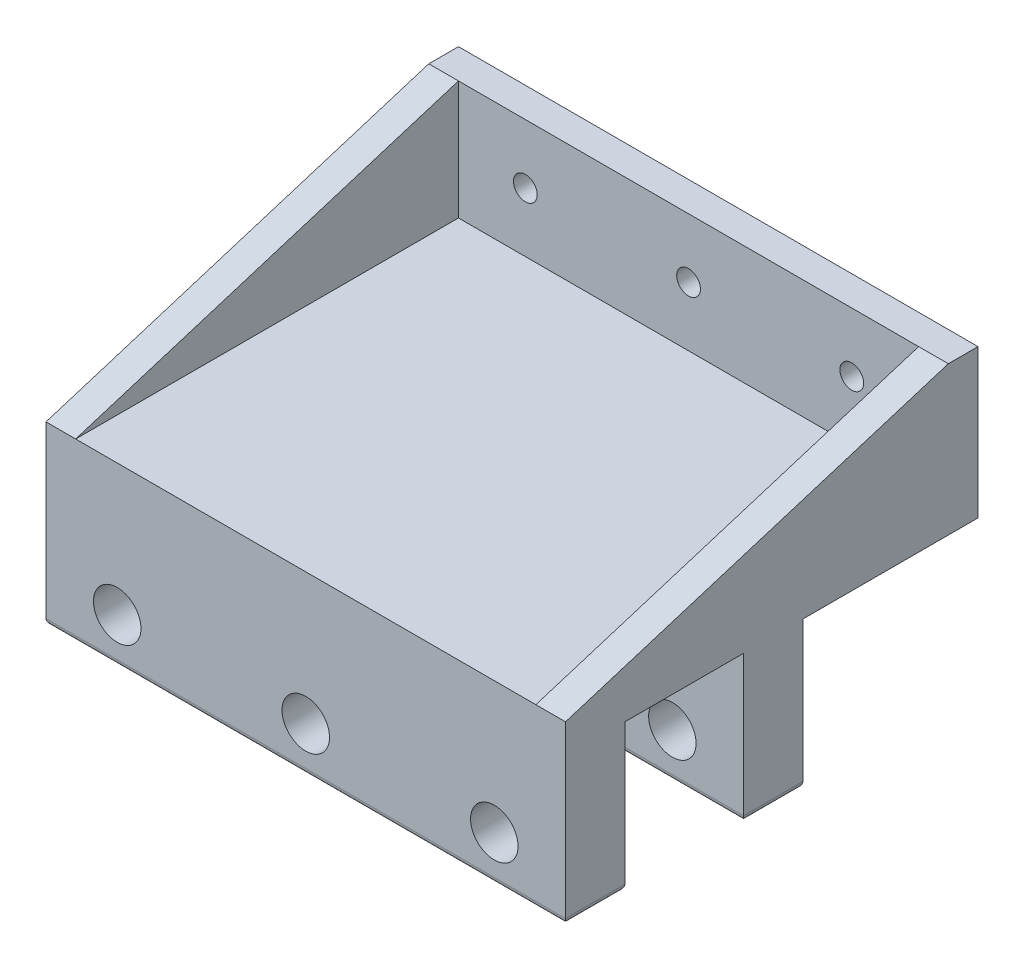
ISO-10303-21;
HEADER;
FILE_DESCRIPTION(('STEP AP214'),'2;1');
FILE_NAME('part.step','',(''),(''),'','','');
FILE_SCHEMA(('AUTOMOTIVE_DESIGN { 1 0 10303 214 1 1 1 1 }'));
ENDSEC;
DATA;
#1=APPLICATION_CONTEXT('core data for automotive mechanical design processes');
#2=APPLICATION_PROTOCOL_DEFINITION('international standard','automotive_design',2000,#1);
#3=PRODUCT_CONTEXT('',#1,'mechanical');
#4=PRODUCT('Part','Part','',(#3));
#5=PRODUCT_RELATED_PRODUCT_CATEGORY('part','',(#4));
#6=PRODUCT_DEFINITION_FORMATION('','',#4);
#7=PRODUCT_DEFINITION_CONTEXT('part definition',#1,'design');
#8=PRODUCT_DEFINITION('design','',#6,#7);
#9=PRODUCT_DEFINITION_SHAPE('','',#8);
#10=(LENGTH_UNIT() NAMED_UNIT(*) SI_UNIT(.MILLI.,.METRE.));
#11=(NAMED_UNIT(*) PLANE_ANGLE_UNIT() SI_UNIT($,.RADIAN.));
#12=(NAMED_UNIT(*) SI_UNIT($,.STERADIAN.) SOLID_ANGLE_UNIT());
#13=UNCERTAINTY_MEASURE_WITH_UNIT(LENGTH_MEASURE(1.E-05),#10,'distance_accuracy_value','');
#14=(GEOMETRIC_REPRESENTATION_CONTEXT(3) GLOBAL_UNCERTAINTY_ASSIGNED_CONTEXT((#13)) GLOBAL_UNIT_ASSIGNED_CONTEXT((#10,
#11,#12)) REPRESENTATION_CONTEXT('',''));
#15=CARTESIAN_POINT('',(0.,0.,0.));
#16=DIRECTION('',(0.,0.,1.));
#17=DIRECTION('',(1.,0.,0.));
#18=AXIS2_PLACEMENT_3D('',#15,#16,#17);
#19=CARTESIAN_POINT('',(91.4321626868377,17.1642721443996,-64.5));
#20=DIRECTION('',(0.,1.,0.));
#21=DIRECTION('',(0.,0.,1.));
#22=AXIS2_PLACEMENT_3D('',#19,#20,#21);
#23=PLANE('',#22);
#24=DIRECTION('',(1.,0.,0.));
#25=VECTOR('',#24,1.);
#26=CARTESIAN_POINT('',(3.89366137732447,17.1642721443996,-5.));
#27=LINE('',#26,#25);
#28=CARTESIAN_POINT('',(3.89366137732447,17.1642721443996,-5.));
#29=VERTEX_POINT('',#28);
#30=CARTESIAN_POINT('',(91.4321626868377,17.1642721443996,-5.));
#31=VERTEX_POINT('',#30);
#32=EDGE_CURVE('E179',#29,#31,#27,.T.);
#33=ORIENTED_EDGE('',*,*,#32,.F.);
#34=DIRECTION('',(0.,0.,1.));
#35=VECTOR('',#34,1.);
#36=CARTESIAN_POINT('',(3.89366137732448,17.1642721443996,-64.5));
#37=LINE('',#36,#35);
#38=CARTESIAN_POINT('',(3.89366137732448,17.1642721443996,-25.));
#39=VERTEX_POINT('',#38);
#40=EDGE_CURVE('E193',#39,#29,#37,.T.);
#41=ORIENTED_EDGE('',*,*,#40,.F.);
#42=DIRECTION('',(1.,0.,0.));
#43=VECTOR('',#42,1.);
#44=CARTESIAN_POINT('',(3.89366137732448,17.1642721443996,-25.));
#45=LINE('',#44,#43);
#46=CARTESIAN_POINT('',(91.4321626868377,17.1642721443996,-25.));
#47=VERTEX_POINT('',#46);
#48=EDGE_CURVE('E418',#39,#47,#45,.T.);
#49=ORIENTED_EDGE('',*,*,#48,.T.);
#50=DIRECTION('',(0.,0.,1.));
#51=VECTOR('',#50,1.);
#52=CARTESIAN_POINT('',(91.4321626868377,17.1642721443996,-64.5));
#53=LINE('',#52,#51);
#54=EDGE_CURVE('E196',#47,#31,#53,.T.);
#55=ORIENTED_EDGE('',*,*,#54,.T.);
#56=EDGE_LOOP('',(#33,#41,#49,#55));
#57=FACE_BOUND('',#56,.T.);
#58=ADVANCED_FACE('F46',(#57),#23,.F.);
#59=CARTESIAN_POINT('',(3.89366137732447,0.,5.));
#60=DIRECTION('',(1.,0.,0.));
#61=DIRECTION('',(0.,1.,0.));
#62=AXIS2_PLACEMENT_3D('',#59,#60,#61);
#63=PLANE('',#62);
#64=DIRECTION('',(0.,1.,0.));
#65=VECTOR('',#64,1.);
#66=CARTESIAN_POINT('',(3.89366137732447,-95.6477064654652,-35.));
#67=LINE('',#66,#65);
#68=CARTESIAN_POINT('',(3.89366137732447,-6.5398792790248,-35.));
#69=VERTEX_POINT('',#68);
#70=CARTESIAN_POINT('',(3.89366137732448,17.1642721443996,-35.));
#71=VERTEX_POINT('',#70);
#72=EDGE_CURVE('E421',#69,#71,#67,.T.);
#73=ORIENTED_EDGE('',*,*,#72,.F.);
#74=DIRECTION('',(0.,0.,1.));
#75=VECTOR('',#74,1.);
#76=CARTESIAN_POINT('',(3.89366137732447,-6.53987927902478,5.));
#77=LINE('',#76,#75);
#78=CARTESIAN_POINT('',(3.89366137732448,-6.5398792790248,-25.));
#79=VERTEX_POINT('',#78);
#80=EDGE_CURVE('E263',#69,#79,#77,.T.);
#81=ORIENTED_EDGE('',*,*,#80,.T.);
#82=DIRECTION('',(0.,1.,0.));
#83=VECTOR('',#82,1.);
#84=CARTESIAN_POINT('',(3.89366137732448,-95.6477064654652,-25.));
#85=LINE('',#84,#83);
#86=EDGE_CURVE('E204',#79,#39,#85,.T.);
#87=ORIENTED_EDGE('',*,*,#86,.T.);
#88=ORIENTED_EDGE('',*,*,#40,.T.);
#89=DIRECTION('',(0.,1.,0.));
#90=VECTOR('',#89,1.);
#91=CARTESIAN_POINT('',(3.89366137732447,-95.2210586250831,-5.));
#92=LINE('',#91,#90);
#93=CARTESIAN_POINT('',(3.89366137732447,-6.5398792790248,-5.));
#94=VERTEX_POINT('',#93);
#95=EDGE_CURVE('E175',#94,#29,#92,.T.);
#96=ORIENTED_EDGE('',*,*,#95,.F.);
#97=DIRECTION('',(0.,0.,-1.));
#98=VECTOR('',#97,1.);
#99=CARTESIAN_POINT('',(3.89366137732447,-6.53987927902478,5.));
#100=LINE('',#99,#98);
#101=CARTESIAN_POINT('',(3.89366137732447,-6.53987927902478,5.));
#102=VERTEX_POINT('',#101);
#103=EDGE_CURVE('E260',#94,#102,#100,.F.);
#104=ORIENTED_EDGE('',*,*,#103,.T.);
#105=DIRECTION('',(0.,-1.,0.));
#106=VECTOR('',#105,1.);
#107=CARTESIAN_POINT('',(3.89366137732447,0.,5.));
#108=LINE('',#107,#106);
#109=CARTESIAN_POINT('',(3.89366137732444,22.1642721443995,5.));
#110=VERTEX_POINT('',#109);
#111=EDGE_CURVE('E229',#110,#102,#108,.T.);
#112=ORIENTED_EDGE('',*,*,#111,.F.);
#113=DIRECTION('',(0.,-0.296166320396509,0.95513638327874));
#114=VECTOR('',#113,1.);
#115=CARTESIAN_POINT('',(3.89366137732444,21.6345404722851,6.70838464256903));
#116=LINE('',#115,#114);
#117=CARTESIAN_POINT('',(3.89366137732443,42.1642721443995,-59.5));
#118=VERTEX_POINT('',#117);
#119=EDGE_CURVE('E371',#118,#110,#116,.T.);
#120=ORIENTED_EDGE('',*,*,#119,.F.);
#121=DIRECTION('',(0.,0.,-1.));
#122=VECTOR('',#121,1.);
#123=CARTESIAN_POINT('',(3.89366137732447,42.1642721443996,-59.5));
#124=LINE('',#123,#122);
#125=CARTESIAN_POINT('',(3.89366137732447,42.1642721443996,-64.5));
#126=VERTEX_POINT('',#125);
#127=EDGE_CURVE('E440',#118,#126,#124,.T.);
#128=ORIENTED_EDGE('',*,*,#127,.T.);
#129=DIRECTION('',(0.,1.,0.));
#130=VECTOR('',#129,1.);
#131=CARTESIAN_POINT('',(3.89366137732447,22.1642721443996,-64.5));
#132=LINE('',#131,#130);
#133=CARTESIAN_POINT('',(3.89366137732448,17.1642721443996,-64.5));
#134=VERTEX_POINT('',#133);
#135=EDGE_CURVE('E207',#134,#126,#132,.T.);
#136=ORIENTED_EDGE('',*,*,#135,.F.);
#137=EDGE_CURVE('E206',#134,#71,#37,.T.);
#138=ORIENTED_EDGE('',*,*,#137,.T.);
#139=EDGE_LOOP('',(#73,#81,#87,#88,#96,#104,#112,#120,#128,#136,#138));
#140=FACE_BOUND('',#139,.T.);
#141=ADVANCED_FACE('F201',(#140),#63,.F.);
#142=CARTESIAN_POINT('',(91.4321626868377,0.,5.));
#143=DIRECTION('',(1.,0.,0.));
#144=DIRECTION('',(0.,1.,0.));
#145=AXIS2_PLACEMENT_3D('',#142,#143,#144);
#146=PLANE('',#145);
#147=DIRECTION('',(0.,1.,0.));
#148=VECTOR('',#147,1.);
#149=CARTESIAN_POINT('',(91.4321626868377,-95.6477064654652,-25.));
#150=LINE('',#149,#148);
#151=CARTESIAN_POINT('',(91.4321626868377,-6.53987927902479,-25.));
#152=VERTEX_POINT('',#151);
#153=EDGE_CURVE('E426',#152,#47,#150,.T.);
#154=ORIENTED_EDGE('',*,*,#153,.F.);
#155=DIRECTION('',(0.,0.,-1.));
#156=VECTOR('',#155,1.);
#157=CARTESIAN_POINT('',(91.4321626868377,-6.53987927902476,-35.));
#158=LINE('',#157,#156);
#159=CARTESIAN_POINT('',(91.4321626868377,-6.53987927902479,-35.));
#160=VERTEX_POINT('',#159);
#161=EDGE_CURVE('E70',#152,#160,#158,.T.);
#162=ORIENTED_EDGE('',*,*,#161,.T.);
#163=DIRECTION('',(0.,1.,0.));
#164=VECTOR('',#163,1.);
#165=CARTESIAN_POINT('',(91.4321626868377,-95.6477064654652,-35.));
#166=LINE('',#165,#164);
#167=CARTESIAN_POINT('',(91.4321626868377,17.1642721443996,-35.));
#168=VERTEX_POINT('',#167);
#169=EDGE_CURVE('E429',#160,#168,#166,.T.);
#170=ORIENTED_EDGE('',*,*,#169,.T.);
#171=CARTESIAN_POINT('',(91.4321626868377,17.1642721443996,-64.5));
#172=VERTEX_POINT('',#171);
#173=EDGE_CURVE('E217',#172,#168,#53,.T.);
#174=ORIENTED_EDGE('',*,*,#173,.F.);
#175=DIRECTION('',(0.,-1.,0.));
#176=VECTOR('',#175,1.);
#177=CARTESIAN_POINT('',(91.4321626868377,22.1642721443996,-64.5));
#178=LINE('',#177,#176);
#179=CARTESIAN_POINT('',(91.4321626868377,42.1642721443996,-64.5));
#180=VERTEX_POINT('',#179);
#181=EDGE_CURVE('E447',#180,#172,#178,.T.);
#182=ORIENTED_EDGE('',*,*,#181,.F.);
#183=DIRECTION('',(0.,0.,-1.));
#184=VECTOR('',#183,1.);
#185=CARTESIAN_POINT('',(91.4321626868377,42.1642721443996,-59.5));
#186=LINE('',#185,#184);
#187=CARTESIAN_POINT('',(91.4321626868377,42.1642721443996,-59.5));
#188=VERTEX_POINT('',#187);
#189=EDGE_CURVE('E444',#188,#180,#186,.T.);
#190=ORIENTED_EDGE('',*,*,#189,.F.);
#191=DIRECTION('',(0.,-0.296166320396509,0.95513638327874));
#192=VECTOR('',#191,1.);
#193=CARTESIAN_POINT('',(91.4321626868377,21.6345404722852,6.70838464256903));
#194=LINE('',#193,#192);
#195=CARTESIAN_POINT('',(91.4321626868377,22.1642721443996,5.));
#196=VERTEX_POINT('',#195);
#197=EDGE_CURVE('E351',#188,#196,#194,.T.);
#198=ORIENTED_EDGE('',*,*,#197,.T.);
#199=DIRECTION('',(0.,-1.,0.));
#200=VECTOR('',#199,1.);
#201=CARTESIAN_POINT('',(91.4321626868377,0.,5.));
#202=LINE('',#201,#200);
#203=CARTESIAN_POINT('',(91.4321626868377,-6.53987927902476,5.));
#204=VERTEX_POINT('',#203);
#205=EDGE_CURVE('E232',#196,#204,#202,.T.);
#206=ORIENTED_EDGE('',*,*,#205,.T.);
#207=DIRECTION('',(0.,0.,-1.));
#208=VECTOR('',#207,1.);
#209=CARTESIAN_POINT('',(91.4321626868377,-6.53987927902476,-5.));
#210=LINE('',#209,#208);
#211=CARTESIAN_POINT('',(91.4321626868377,-6.53987927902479,-5.));
#212=VERTEX_POINT('',#211);
#213=EDGE_CURVE('E292',#204,#212,#210,.T.);
#214=ORIENTED_EDGE('',*,*,#213,.T.);
#215=DIRECTION('',(0.,1.,0.));
#216=VECTOR('',#215,1.);
#217=CARTESIAN_POINT('',(91.4321626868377,-95.2210586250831,-5.));
#218=LINE('',#217,#216);
#219=EDGE_CURVE('E188',#212,#31,#218,.T.);
#220=ORIENTED_EDGE('',*,*,#219,.T.);
#221=ORIENTED_EDGE('',*,*,#54,.F.);
#222=EDGE_LOOP('',(#154,#162,#170,#174,#182,#190,#198,#206,#214,#220,#221));
#223=FACE_BOUND('',#222,.T.);
#224=ADVANCED_FACE('F341',(#223),#146,.T.);
#225=CARTESIAN_POINT('',(0.,0.,5.));
#226=DIRECTION('',(0.,0.,1.));
#227=DIRECTION('',(1.,0.,0.));
#228=AXIS2_PLACEMENT_3D('',#225,#226,#227);
#229=PLANE('',#228);
#230=CARTESIAN_POINT('',(47.662912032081,0.,5.));
#231=DIRECTION('',(0.,0.,1.));
#232=DIRECTION('',(1.,0.,0.));
#233=AXIS2_PLACEMENT_3D('',#230,#231,#232);
#234=CIRCLE('',#233,4.);
#235=CARTESIAN_POINT('',(51.662912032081,0.,5.));
#236=VERTEX_POINT('',#235);
#237=EDGE_CURVE('E221',#236,#236,#234,.T.);
#238=ORIENTED_EDGE('',*,*,#237,.F.);
#239=EDGE_LOOP('',(#238));
#240=FACE_BOUND('',#239,.T.);
#241=CARTESIAN_POINT('',(79.4321626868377,0.,5.));
#242=DIRECTION('',(0.,0.,1.));
#243=DIRECTION('',(1.,0.,0.));
#244=AXIS2_PLACEMENT_3D('',#241,#242,#243);
#245=CIRCLE('',#244,4.00000000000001);
#246=CARTESIAN_POINT('',(83.4321626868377,0.,5.));
#247=VERTEX_POINT('',#246);
#248=EDGE_CURVE('E225',#247,#247,#245,.T.);
#249=ORIENTED_EDGE('',*,*,#248,.F.);
#250=EDGE_LOOP('',(#249));
#251=FACE_BOUND('',#250,.T.);
#252=CARTESIAN_POINT('',(15.8936613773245,0.,5.));
#253=DIRECTION('',(0.,0.,1.));
#254=DIRECTION('',(1.,0.,0.));
#255=AXIS2_PLACEMENT_3D('',#252,#253,#254);
#256=CIRCLE('',#255,4.);
#257=CARTESIAN_POINT('',(19.8936613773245,0.,5.));
#258=VERTEX_POINT('',#257);
#259=EDGE_CURVE('E239',#258,#258,#256,.T.);
#260=ORIENTED_EDGE('',*,*,#259,.F.);
#261=EDGE_LOOP('',(#260));
#262=FACE_BOUND('',#261,.T.);
#263=ORIENTED_EDGE('',*,*,#111,.T.);
#264=DIRECTION('',(1.,0.,0.));
#265=VECTOR('',#264,1.);
#266=CARTESIAN_POINT('',(91.4321626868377,-6.53987927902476,5.));
#267=LINE('',#266,#265);
#268=EDGE_CURVE('E11',#102,#204,#267,.T.);
#269=ORIENTED_EDGE('',*,*,#268,.T.);
#270=ORIENTED_EDGE('',*,*,#205,.F.);
#271=DIRECTION('',(1.,0.,0.));
#272=VECTOR('',#271,1.);
#273=CARTESIAN_POINT('',(3.89366137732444,22.1642721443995,5.));
#274=LINE('',#273,#272);
#275=CARTESIAN_POINT('',(86.4321626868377,22.1642721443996,5.));
#276=VERTEX_POINT('',#275);
#277=EDGE_CURVE('E381',#276,#196,#274,.T.);
#278=ORIENTED_EDGE('',*,*,#277,.F.);
#279=DIRECTION('',(1.,0.,0.));
#280=VECTOR('',#279,1.);
#281=CARTESIAN_POINT('',(0.,22.1642721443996,5.));
#282=LINE('',#281,#280);
#283=CARTESIAN_POINT('',(8.89366137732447,22.1642721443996,5.00000000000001));
#284=VERTEX_POINT('',#283);
#285=EDGE_CURVE('E235',#284,#276,#282,.T.);
#286=ORIENTED_EDGE('',*,*,#285,.F.);
#287=EDGE_CURVE('E377',#110,#284,#274,.T.);
#288=ORIENTED_EDGE('',*,*,#287,.F.);
#289=EDGE_LOOP('',(#263,#269,#270,#278,#286,#288));
#290=FACE_BOUND('',#289,.T.);
#291=ADVANCED_FACE('F544',(#240,#251,#262,#290),#229,.T.);
#292=CARTESIAN_POINT('',(91.4321626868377,42.1642721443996,-59.5));
#293=DIRECTION('',(0.,1.,0.));
#294=DIRECTION('',(0.,0.,1.));
#295=AXIS2_PLACEMENT_3D('',#292,#293,#294);
#296=PLANE('',#295);
#297=ORIENTED_EDGE('',*,*,#127,.F.);
#298=DIRECTION('',(1.,0.,0.));
#299=VECTOR('',#298,1.);
#300=CARTESIAN_POINT('',(3.89366137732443,42.1642721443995,-59.5));
#301=LINE('',#300,#299);
#302=CARTESIAN_POINT('',(8.89366137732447,42.1642721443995,-59.5));
#303=VERTEX_POINT('',#302);
#304=EDGE_CURVE('E382',#118,#303,#301,.T.);
#305=ORIENTED_EDGE('',*,*,#304,.T.);
#306=DIRECTION('',(1.,0.,0.));
#307=VECTOR('',#306,1.);
#308=CARTESIAN_POINT('',(91.4321626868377,42.1642721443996,-59.5));
#309=LINE('',#308,#307);
#310=CARTESIAN_POINT('',(86.4321626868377,42.1642721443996,-59.5));
#311=VERTEX_POINT('',#310);
#312=EDGE_CURVE('E436',#303,#311,#309,.T.);
#313=ORIENTED_EDGE('',*,*,#312,.T.);
#314=EDGE_CURVE('E374',#311,#188,#301,.T.);
#315=ORIENTED_EDGE('',*,*,#314,.T.);
#316=ORIENTED_EDGE('',*,*,#189,.T.);
#317=DIRECTION('',(1.,0.,0.));
#318=VECTOR('',#317,1.);
#319=CARTESIAN_POINT('',(91.4321626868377,42.1642721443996,-64.5));
#320=LINE('',#319,#318);
#321=EDGE_CURVE('E432',#126,#180,#320,.T.);
#322=ORIENTED_EDGE('',*,*,#321,.F.);
#323=EDGE_LOOP('',(#297,#305,#313,#315,#316,#322));
#324=FACE_BOUND('',#323,.T.);
#325=ADVANCED_FACE('F467',(#324),#296,.T.);
#326=CARTESIAN_POINT('',(8.89366137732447,42.1642721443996,25.6155281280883));
#327=DIRECTION('',(1.,0.,0.));
#328=DIRECTION('',(0.,1.,0.));
#329=AXIS2_PLACEMENT_3D('',#326,#327,#328);
#330=PLANE('',#329);
#331=DIRECTION('',(0.,-1.,0.));
#332=VECTOR('',#331,1.);
#333=CARTESIAN_POINT('',(8.89366137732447,42.1642721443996,-59.5));
#334=LINE('',#333,#332);
#335=CARTESIAN_POINT('',(8.89366137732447,22.1642721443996,-59.5));
#336=VERTEX_POINT('',#335);
#337=EDGE_CURVE('E397',#303,#336,#334,.T.);
#338=ORIENTED_EDGE('',*,*,#337,.F.);
#339=DIRECTION('',(0.,-0.296166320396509,0.95513638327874));
#340=VECTOR('',#339,1.);
#341=CARTESIAN_POINT('',(8.89366137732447,18.0868572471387,18.1496630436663));
#342=LINE('',#341,#340);
#343=EDGE_CURVE('E380',#303,#284,#342,.T.);
#344=ORIENTED_EDGE('',*,*,#343,.T.);
#345=DIRECTION('',(0.,0.,-1.));
#346=VECTOR('',#345,1.);
#347=CARTESIAN_POINT('',(8.89366137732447,22.1642721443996,25.6155281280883));
#348=LINE('',#347,#346);
#349=EDGE_CURVE('E394',#284,#336,#348,.T.);
#350=ORIENTED_EDGE('',*,*,#349,.T.);
#351=EDGE_LOOP('',(#338,#344,#350));
#352=FACE_BOUND('',#351,.T.);
#353=ADVANCED_FACE('F543',(#352),#330,.T.);
#354=CARTESIAN_POINT('',(86.4321626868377,42.1642721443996,25.6155281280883));
#355=DIRECTION('',(1.,0.,0.));
#356=DIRECTION('',(0.,0.,-1.));
#357=AXIS2_PLACEMENT_3D('',#354,#355,#356);
#358=PLANE('',#357);
#359=DIRECTION('',(0.,-0.296166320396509,0.95513638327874));
#360=VECTOR('',#359,1.);
#361=CARTESIAN_POINT('',(86.4321626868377,18.0868572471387,18.1496630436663));
#362=LINE('',#361,#360);
#363=EDGE_CURVE('E243',#311,#276,#362,.T.);
#364=ORIENTED_EDGE('',*,*,#363,.F.);
#365=DIRECTION('',(0.,-1.,0.));
#366=VECTOR('',#365,1.);
#367=CARTESIAN_POINT('',(86.4321626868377,42.1642721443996,-59.5));
#368=LINE('',#367,#366);
#369=CARTESIAN_POINT('',(86.4321626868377,22.1642721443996,-59.5));
#370=VERTEX_POINT('',#369);
#371=EDGE_CURVE('E389',#311,#370,#368,.T.);
#372=ORIENTED_EDGE('',*,*,#371,.T.);
#373=DIRECTION('',(0.,0.,-1.));
#374=VECTOR('',#373,1.);
#375=CARTESIAN_POINT('',(86.4321626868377,22.1642721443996,25.6155281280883));
#376=LINE('',#375,#374);
#377=EDGE_CURVE('E390',#276,#370,#376,.T.);
#378=ORIENTED_EDGE('',*,*,#377,.F.);
#379=EDGE_LOOP('',(#364,#372,#378));
#380=FACE_BOUND('',#379,.T.);
#381=ADVANCED_FACE('F536',(#380),#358,.F.);
#382=CARTESIAN_POINT('',(0.,22.1642721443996,5.));
#383=DIRECTION('',(0.,1.,0.));
#384=DIRECTION('',(0.,0.,1.));
#385=AXIS2_PLACEMENT_3D('',#382,#383,#384);
#386=PLANE('',#385);
#387=ORIENTED_EDGE('',*,*,#285,.T.);
#388=ORIENTED_EDGE('',*,*,#377,.T.);
#389=DIRECTION('',(-1.,0.,0.));
#390=VECTOR('',#389,1.);
#391=CARTESIAN_POINT('',(91.4321626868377,22.1642721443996,-59.5));
#392=LINE('',#391,#390);
#393=EDGE_CURVE('E433',#370,#336,#392,.T.);
#394=ORIENTED_EDGE('',*,*,#393,.T.);
#395=ORIENTED_EDGE('',*,*,#349,.F.);
#396=EDGE_LOOP('',(#387,#388,#394,#395));
#397=FACE_BOUND('',#396,.T.);
#398=ADVANCED_FACE('F530',(#397),#386,.T.);
#399=CARTESIAN_POINT('',(0.,0.,-59.5));
#400=DIRECTION('',(0.,0.,1.));
#401=DIRECTION('',(1.,0.,0.));
#402=AXIS2_PLACEMENT_3D('',#399,#400,#401);
#403=PLANE('',#402);
#404=CARTESIAN_POINT('',(20.1629120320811,32.1642721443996,-59.5));
#405=DIRECTION('',(0.,0.,1.));
#406=DIRECTION('',(1.,0.,0.));
#407=AXIS2_PLACEMENT_3D('',#404,#405,#406);
#408=CIRCLE('',#407,2.);
#409=CARTESIAN_POINT('',(22.1629120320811,32.1642721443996,-59.5));
#410=VERTEX_POINT('',#409);
#411=EDGE_CURVE('E352',#410,#410,#408,.T.);
#412=ORIENTED_EDGE('',*,*,#411,.F.);
#413=EDGE_LOOP('',(#412));
#414=FACE_BOUND('',#413,.T.);
#415=CARTESIAN_POINT('',(47.662912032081,32.1642721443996,-59.5));
#416=DIRECTION('',(0.,0.,1.));
#417=DIRECTION('',(1.,0.,0.));
#418=AXIS2_PLACEMENT_3D('',#415,#416,#417);
#419=CIRCLE('',#418,2.);
#420=CARTESIAN_POINT('',(49.6629120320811,32.1642721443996,-59.5));
#421=VERTEX_POINT('',#420);
#422=EDGE_CURVE('E360',#421,#421,#419,.T.);
#423=ORIENTED_EDGE('',*,*,#422,.F.);
#424=EDGE_LOOP('',(#423));
#425=FACE_BOUND('',#424,.T.);
#426=CARTESIAN_POINT('',(75.1629120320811,32.1642721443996,-59.5));
#427=DIRECTION('',(0.,0.,1.));
#428=DIRECTION('',(1.,0.,0.));
#429=AXIS2_PLACEMENT_3D('',#426,#427,#428);
#430=CIRCLE('',#429,2.);
#431=CARTESIAN_POINT('',(77.1629120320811,32.1642721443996,-59.5));
#432=VERTEX_POINT('',#431);
#433=EDGE_CURVE('E187',#432,#432,#430,.T.);
#434=ORIENTED_EDGE('',*,*,#433,.F.);
#435=EDGE_LOOP('',(#434));
#436=FACE_BOUND('',#435,.T.);
#437=ORIENTED_EDGE('',*,*,#393,.F.);
#438=ORIENTED_EDGE('',*,*,#371,.F.);
#439=ORIENTED_EDGE('',*,*,#312,.F.);
#440=ORIENTED_EDGE('',*,*,#337,.T.);
#441=EDGE_LOOP('',(#437,#438,#439,#440));
#442=FACE_BOUND('',#441,.T.);
#443=ADVANCED_FACE('F521',(#414,#425,#436,#442),#403,.T.);
#444=DIRECTION('',(1.,0.,0.));
#445=VECTOR('',#444,1.);
#446=CARTESIAN_POINT('',(3.89366137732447,17.1642721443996,-35.));
#447=LINE('',#446,#445);
#448=EDGE_CURVE('E257',#71,#168,#447,.T.);
#449=ORIENTED_EDGE('',*,*,#448,.F.);
#450=ORIENTED_EDGE('',*,*,#137,.F.);
#451=DIRECTION('',(-1.,0.,0.));
#452=VECTOR('',#451,1.);
#453=CARTESIAN_POINT('',(91.4321626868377,17.1642721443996,-64.5));
#454=LINE('',#453,#452);
#455=EDGE_CURVE('E213',#172,#134,#454,.T.);
#456=ORIENTED_EDGE('',*,*,#455,.F.);
#457=ORIENTED_EDGE('',*,*,#173,.T.);
#458=EDGE_LOOP('',(#449,#450,#456,#457));
#459=FACE_BOUND('',#458,.T.);
#460=ADVANCED_FACE('F462',(#459),#23,.F.);
#461=CARTESIAN_POINT('',(0.,-7.53987927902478,5.));
#462=DIRECTION('',(0.,1.,0.));
#463=DIRECTION('',(-1.,0.,0.));
#464=AXIS2_PLACEMENT_3D('',#461,#462,#463);
#465=PLANE('',#464);
#466=DIRECTION('',(0.,0.,-1.));
#467=VECTOR('',#466,1.);
#468=CARTESIAN_POINT('',(4.89366137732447,-7.53987927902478,5.));
#469=LINE('',#468,#467);
#470=CARTESIAN_POINT('',(4.89366137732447,-7.53987927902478,4.));
#471=VERTEX_POINT('',#470);
#472=CARTESIAN_POINT('',(4.89366137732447,-7.53987927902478,-4.));
#473=VERTEX_POINT('',#472);
#474=EDGE_CURVE('E285',#471,#473,#469,.T.);
#475=ORIENTED_EDGE('',*,*,#474,.T.);
#476=DIRECTION('',(-1.,0.,0.));
#477=VECTOR('',#476,1.);
#478=CARTESIAN_POINT('',(0.,-7.53987927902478,-4.));
#479=LINE('',#478,#477);
#480=CARTESIAN_POINT('',(90.4321626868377,-7.53987927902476,-4.));
#481=VERTEX_POINT('',#480);
#482=EDGE_CURVE('E289',#473,#481,#479,.F.);
#483=ORIENTED_EDGE('',*,*,#482,.T.);
#484=DIRECTION('',(0.,0.,-1.));
#485=VECTOR('',#484,1.);
#486=CARTESIAN_POINT('',(90.4321626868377,-7.53987927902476,5.));
#487=LINE('',#486,#485);
#488=CARTESIAN_POINT('',(90.4321626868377,-7.53987927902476,4.));
#489=VERTEX_POINT('',#488);
#490=EDGE_CURVE('E282',#481,#489,#487,.F.);
#491=ORIENTED_EDGE('',*,*,#490,.T.);
#492=DIRECTION('',(1.,0.,0.));
#493=VECTOR('',#492,1.);
#494=CARTESIAN_POINT('',(3.89366137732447,-7.53987927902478,4.));
#495=LINE('',#494,#493);
#496=EDGE_CURVE('E279',#489,#471,#495,.F.);
#497=ORIENTED_EDGE('',*,*,#496,.T.);
#498=EDGE_LOOP('',(#475,#483,#491,#497));
#499=FACE_BOUND('',#498,.T.);
#500=ADVANCED_FACE('F520',(#499),#465,.F.);
#501=CARTESIAN_POINT('',(79.4321626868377,0.,5.));
#502=DIRECTION('',(0.,0.,-1.));
#503=DIRECTION('',(-1.,0.,0.));
#504=AXIS2_PLACEMENT_3D('',#501,#502,#503);
#505=CYLINDRICAL_SURFACE('',#504,4.00000000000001);
#506=ORIENTED_EDGE('',*,*,#248,.T.);
#507=EDGE_LOOP('',(#506));
#508=FACE_BOUND('',#507,.T.);
#509=CARTESIAN_POINT('',(79.4321626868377,0.,-5.));
#510=DIRECTION('',(0.,0.,-1.));
#511=DIRECTION('',(-1.,0.,0.));
#512=AXIS2_PLACEMENT_3D('',#509,#510,#511);
#513=CIRCLE('',#512,4.00000000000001);
#514=CARTESIAN_POINT('',(75.4321626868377,0.,-5.));
#515=VERTEX_POINT('',#514);
#516=EDGE_CURVE('E198',#515,#515,#513,.T.);
#517=ORIENTED_EDGE('',*,*,#516,.T.);
#518=EDGE_LOOP('',(#517));
#519=FACE_BOUND('',#518,.T.);
#520=ADVANCED_FACE('F527',(#508,#519),#505,.F.);
#521=CARTESIAN_POINT('',(47.662912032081,0.,5.));
#522=DIRECTION('',(0.,0.,-1.));
#523=DIRECTION('',(-1.,0.,0.));
#524=AXIS2_PLACEMENT_3D('',#521,#522,#523);
#525=CYLINDRICAL_SURFACE('',#524,4.);
#526=ORIENTED_EDGE('',*,*,#237,.T.);
#527=EDGE_LOOP('',(#526));
#528=FACE_BOUND('',#527,.T.);
#529=CARTESIAN_POINT('',(47.662912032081,0.,-5.));
#530=DIRECTION('',(0.,0.,-1.));
#531=DIRECTION('',(-1.,0.,0.));
#532=AXIS2_PLACEMENT_3D('',#529,#530,#531);
#533=CIRCLE('',#532,4.00000000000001);
#534=CARTESIAN_POINT('',(43.662912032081,0.,-5.));
#535=VERTEX_POINT('',#534);
#536=EDGE_CURVE('E624',#535,#535,#533,.T.);
#537=ORIENTED_EDGE('',*,*,#536,.T.);
#538=EDGE_LOOP('',(#537));
#539=FACE_BOUND('',#538,.T.);
#540=ADVANCED_FACE('F554',(#528,#539),#525,.F.);
#541=CARTESIAN_POINT('',(15.8936613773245,0.,5.));
#542=DIRECTION('',(0.,0.,-1.));
#543=DIRECTION('',(-1.,0.,0.));
#544=AXIS2_PLACEMENT_3D('',#541,#542,#543);
#545=CYLINDRICAL_SURFACE('',#544,4.);
#546=ORIENTED_EDGE('',*,*,#259,.T.);
#547=EDGE_LOOP('',(#546));
#548=FACE_BOUND('',#547,.T.);
#549=CARTESIAN_POINT('',(15.8936613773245,0.,-5.));
#550=DIRECTION('',(0.,0.,-1.));
#551=DIRECTION('',(-1.,0.,0.));
#552=AXIS2_PLACEMENT_3D('',#549,#550,#551);
#553=CIRCLE('',#552,4.00000000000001);
#554=CARTESIAN_POINT('',(11.8936613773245,0.,-5.));
#555=VERTEX_POINT('',#554);
#556=EDGE_CURVE('E319',#555,#555,#553,.T.);
#557=ORIENTED_EDGE('',*,*,#556,.T.);
#558=EDGE_LOOP('',(#557));
#559=FACE_BOUND('',#558,.T.);
#560=ADVANCED_FACE('F546',(#548,#559),#545,.F.);
#561=CARTESIAN_POINT('',(0.,0.,-64.5));
#562=DIRECTION('',(0.,0.,-1.));
#563=DIRECTION('',(-1.,0.,0.));
#564=AXIS2_PLACEMENT_3D('',#561,#562,#563);
#565=PLANE('',#564);
#566=CARTESIAN_POINT('',(20.1629120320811,32.1642721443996,-64.5));
#567=DIRECTION('',(0.,0.,1.));
#568=DIRECTION('',(1.,0.,0.));
#569=AXIS2_PLACEMENT_3D('',#566,#567,#568);
#570=CIRCLE('',#569,2.);
#571=CARTESIAN_POINT('',(22.1629120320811,32.1642721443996,-64.5));
#572=VERTEX_POINT('',#571);
#573=EDGE_CURVE('E347',#572,#572,#570,.T.);
#574=ORIENTED_EDGE('',*,*,#573,.T.);
#575=EDGE_LOOP('',(#574));
#576=FACE_BOUND('',#575,.T.);
#577=CARTESIAN_POINT('',(47.662912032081,32.1642721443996,-64.5));
#578=DIRECTION('',(0.,0.,1.));
#579=DIRECTION('',(1.,0.,0.));
#580=AXIS2_PLACEMENT_3D('',#577,#578,#579);
#581=CIRCLE('',#580,2.);
#582=CARTESIAN_POINT('',(49.6629120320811,32.1642721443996,-64.5));
#583=VERTEX_POINT('',#582);
#584=EDGE_CURVE('E356',#583,#583,#581,.T.);
#585=ORIENTED_EDGE('',*,*,#584,.T.);
#586=EDGE_LOOP('',(#585));
#587=FACE_BOUND('',#586,.T.);
#588=CARTESIAN_POINT('',(75.1629120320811,32.1642721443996,-64.5));
#589=DIRECTION('',(0.,0.,1.));
#590=DIRECTION('',(1.,0.,0.));
#591=AXIS2_PLACEMENT_3D('',#588,#589,#590);
#592=CIRCLE('',#591,2.);
#593=CARTESIAN_POINT('',(77.1629120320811,32.1642721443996,-64.5));
#594=VERTEX_POINT('',#593);
#595=EDGE_CURVE('E364',#594,#594,#592,.T.);
#596=ORIENTED_EDGE('',*,*,#595,.T.);
#597=EDGE_LOOP('',(#596));
#598=FACE_BOUND('',#597,.T.);
#599=ORIENTED_EDGE('',*,*,#181,.T.);
#600=ORIENTED_EDGE('',*,*,#455,.T.);
#601=ORIENTED_EDGE('',*,*,#135,.T.);
#602=ORIENTED_EDGE('',*,*,#321,.T.);
#603=EDGE_LOOP('',(#599,#600,#601,#602));
#604=FACE_BOUND('',#603,.T.);
#605=ADVANCED_FACE('F455',(#576,#587,#598,#604),#565,.T.);
#606=CARTESIAN_POINT('',(3.89366137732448,-95.6477064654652,-25.));
#607=DIRECTION('',(0.,0.,1.));
#608=DIRECTION('',(1.,0.,0.));
#609=AXIS2_PLACEMENT_3D('',#606,#607,#608);
#610=PLANE('',#609);
#611=CARTESIAN_POINT('',(15.8936613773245,0.,-25.));
#612=DIRECTION('',(0.,0.,1.));
#613=DIRECTION('',(1.,0.,0.));
#614=AXIS2_PLACEMENT_3D('',#611,#612,#613);
#615=CIRCLE('',#614,4.);
#616=CARTESIAN_POINT('',(19.8936613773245,0.,-25.));
#617=VERTEX_POINT('',#616);
#618=EDGE_CURVE('E249',#617,#617,#615,.T.);
#619=ORIENTED_EDGE('',*,*,#618,.F.);
#620=EDGE_LOOP('',(#619));
#621=FACE_BOUND('',#620,.T.);
#622=CARTESIAN_POINT('',(47.662912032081,0.,-25.));
#623=DIRECTION('',(0.,0.,1.));
#624=DIRECTION('',(1.,0.,0.));
#625=AXIS2_PLACEMENT_3D('',#622,#623,#624);
#626=CIRCLE('',#625,4.00000000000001);
#627=CARTESIAN_POINT('',(51.662912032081,0.,-25.));
#628=VERTEX_POINT('',#627);
#629=EDGE_CURVE('E408',#628,#628,#626,.T.);
#630=ORIENTED_EDGE('',*,*,#629,.F.);
#631=EDGE_LOOP('',(#630));
#632=FACE_BOUND('',#631,.T.);
#633=CARTESIAN_POINT('',(79.4321626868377,0.,-25.));
#634=DIRECTION('',(0.,0.,1.));
#635=DIRECTION('',(1.,0.,0.));
#636=AXIS2_PLACEMENT_3D('',#633,#634,#635);
#637=CIRCLE('',#636,4.00000000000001);
#638=CARTESIAN_POINT('',(83.4321626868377,0.,-25.));
#639=VERTEX_POINT('',#638);
#640=EDGE_CURVE('E401',#639,#639,#637,.T.);
#641=ORIENTED_EDGE('',*,*,#640,.F.);
#642=EDGE_LOOP('',(#641));
#643=FACE_BOUND('',#642,.T.);
#644=ORIENTED_EDGE('',*,*,#86,.F.);
#645=DIRECTION('',(-1.,0.,0.));
#646=VECTOR('',#645,1.);
#647=CARTESIAN_POINT('',(91.4321626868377,-6.53987927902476,-25.));
#648=LINE('',#647,#646);
#649=EDGE_CURVE('E300',#79,#152,#648,.F.);
#650=ORIENTED_EDGE('',*,*,#649,.T.);
#651=ORIENTED_EDGE('',*,*,#153,.T.);
#652=ORIENTED_EDGE('',*,*,#48,.F.);
#653=EDGE_LOOP('',(#644,#650,#651,#652));
#654=FACE_BOUND('',#653,.T.);
#655=ADVANCED_FACE('F490',(#621,#632,#643,#654),#610,.T.);
#656=CARTESIAN_POINT('',(3.89366137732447,-95.6477064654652,-35.));
#657=DIRECTION('',(0.,0.,1.));
#658=DIRECTION('',(1.,0.,0.));
#659=AXIS2_PLACEMENT_3D('',#656,#657,#658);
#660=PLANE('',#659);
#661=CARTESIAN_POINT('',(15.8936613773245,0.,-35.));
#662=DIRECTION('',(0.,0.,1.));
#663=DIRECTION('',(1.,0.,0.));
#664=AXIS2_PLACEMENT_3D('',#661,#662,#663);
#665=CIRCLE('',#664,4.);
#666=CARTESIAN_POINT('',(19.8936613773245,0.,-35.));
#667=VERTEX_POINT('',#666);
#668=EDGE_CURVE('E253',#667,#667,#665,.T.);
#669=ORIENTED_EDGE('',*,*,#668,.T.);
#670=EDGE_LOOP('',(#669));
#671=FACE_BOUND('',#670,.T.);
#672=CARTESIAN_POINT('',(47.662912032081,0.,-35.));
#673=DIRECTION('',(0.,0.,1.));
#674=DIRECTION('',(1.,0.,0.));
#675=AXIS2_PLACEMENT_3D('',#672,#673,#674);
#676=CIRCLE('',#675,4.00000000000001);
#677=CARTESIAN_POINT('',(51.662912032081,0.,-35.));
#678=VERTEX_POINT('',#677);
#679=EDGE_CURVE('E248',#678,#678,#676,.T.);
#680=ORIENTED_EDGE('',*,*,#679,.T.);
#681=EDGE_LOOP('',(#680));
#682=FACE_BOUND('',#681,.T.);
#683=CARTESIAN_POINT('',(79.4321626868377,0.,-35.));
#684=DIRECTION('',(0.,0.,1.));
#685=DIRECTION('',(1.,0.,0.));
#686=AXIS2_PLACEMENT_3D('',#683,#684,#685);
#687=CIRCLE('',#686,4.00000000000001);
#688=CARTESIAN_POINT('',(83.4321626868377,0.,-35.));
#689=VERTEX_POINT('',#688);
#690=EDGE_CURVE('E244',#689,#689,#687,.T.);
#691=ORIENTED_EDGE('',*,*,#690,.T.);
#692=EDGE_LOOP('',(#691));
#693=FACE_BOUND('',#692,.T.);
#694=ORIENTED_EDGE('',*,*,#169,.F.);
#695=DIRECTION('',(-1.,0.,0.));
#696=VECTOR('',#695,1.);
#697=CARTESIAN_POINT('',(3.89366137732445,-6.53987927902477,-35.));
#698=LINE('',#697,#696);
#699=EDGE_CURVE('E297',#160,#69,#698,.T.);
#700=ORIENTED_EDGE('',*,*,#699,.T.);
#701=ORIENTED_EDGE('',*,*,#72,.T.);
#702=ORIENTED_EDGE('',*,*,#448,.T.);
#703=EDGE_LOOP('',(#694,#700,#701,#702));
#704=FACE_BOUND('',#703,.T.);
#705=ADVANCED_FACE('F472',(#671,#682,#693,#704),#660,.F.);
#706=CARTESIAN_POINT('',(0.,-7.53987927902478,5.));
#707=DIRECTION('',(0.,1.,0.));
#708=DIRECTION('',(-1.,0.,0.));
#709=AXIS2_PLACEMENT_3D('',#706,#707,#708);
#710=PLANE('',#709);
#711=DIRECTION('',(0.,0.,1.));
#712=VECTOR('',#711,1.);
#713=CARTESIAN_POINT('',(4.89366137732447,-7.53987927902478,5.));
#714=LINE('',#713,#712);
#715=CARTESIAN_POINT('',(4.89366137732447,-7.53987927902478,-26.));
#716=VERTEX_POINT('',#715);
#717=CARTESIAN_POINT('',(4.89366137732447,-7.53987927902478,-34.));
#718=VERTEX_POINT('',#717);
#719=EDGE_CURVE('E272',#716,#718,#714,.F.);
#720=ORIENTED_EDGE('',*,*,#719,.T.);
#721=DIRECTION('',(-1.,0.,0.));
#722=VECTOR('',#721,1.);
#723=CARTESIAN_POINT('',(0.,-7.53987927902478,-34.));
#724=LINE('',#723,#722);
#725=CARTESIAN_POINT('',(90.4321626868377,-7.53987927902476,-34.));
#726=VERTEX_POINT('',#725);
#727=EDGE_CURVE('E276',#718,#726,#724,.F.);
#728=ORIENTED_EDGE('',*,*,#727,.T.);
#729=DIRECTION('',(0.,0.,-1.));
#730=VECTOR('',#729,1.);
#731=CARTESIAN_POINT('',(90.4321626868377,-7.53987927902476,-25.));
#732=LINE('',#731,#730);
#733=CARTESIAN_POINT('',(90.4321626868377,-7.53987927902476,-26.));
#734=VERTEX_POINT('',#733);
#735=EDGE_CURVE('E269',#726,#734,#732,.F.);
#736=ORIENTED_EDGE('',*,*,#735,.T.);
#737=DIRECTION('',(-1.,0.,0.));
#738=VECTOR('',#737,1.);
#739=CARTESIAN_POINT('',(3.89366137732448,-7.53987927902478,-26.));
#740=LINE('',#739,#738);
#741=EDGE_CURVE('E266',#734,#716,#740,.T.);
#742=ORIENTED_EDGE('',*,*,#741,.T.);
#743=EDGE_LOOP('',(#720,#728,#736,#742));
#744=FACE_BOUND('',#743,.T.);
#745=ADVANCED_FACE('F495',(#744),#710,.F.);
#746=CARTESIAN_POINT('',(79.4321626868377,0.,-64.5));
#747=DIRECTION('',(0.,0.,1.));
#748=DIRECTION('',(1.,0.,0.));
#749=AXIS2_PLACEMENT_3D('',#746,#747,#748);
#750=CYLINDRICAL_SURFACE('',#749,4.00000000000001);
#751=CARTESIAN_POINT('',(83.4321626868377,0.,-25.));
#752=CARTESIAN_POINT('',(83.4321626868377,0.,-25.1041666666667));
#753=CARTESIAN_POINT('',(83.4321626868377,0.,-25.2083333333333));
#754=CARTESIAN_POINT('',(83.4321626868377,0.,-25.4166666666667));
#755=CARTESIAN_POINT('',(83.4321626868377,0.,-25.5208333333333));
#756=CARTESIAN_POINT('',(83.4321626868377,0.,-25.7291666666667));
#757=CARTESIAN_POINT('',(83.4321626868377,0.,-25.8333333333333));
#758=CARTESIAN_POINT('',(83.4321626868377,0.,-26.0416666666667));
#759=CARTESIAN_POINT('',(83.4321626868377,0.,-26.1458333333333));
#760=CARTESIAN_POINT('',(83.4321626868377,0.,-26.3541666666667));
#761=CARTESIAN_POINT('',(83.4321626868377,0.,-26.4583333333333));
#762=CARTESIAN_POINT('',(83.4321626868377,0.,-26.6666666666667));
#763=CARTESIAN_POINT('',(83.4321626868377,0.,-26.7708333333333));
#764=CARTESIAN_POINT('',(83.4321626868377,0.,-26.9791666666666));
#765=CARTESIAN_POINT('',(83.4321626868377,0.,-27.0833333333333));
#766=CARTESIAN_POINT('',(83.4321626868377,0.,-27.2916666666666));
#767=CARTESIAN_POINT('',(83.4321626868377,0.,-27.3958333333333));
#768=CARTESIAN_POINT('',(83.4321626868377,0.,-27.6041666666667));
#769=CARTESIAN_POINT('',(83.4321626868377,0.,-27.7083333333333));
#770=CARTESIAN_POINT('',(83.4321626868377,0.,-27.9166666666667));
#771=CARTESIAN_POINT('',(83.4321626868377,0.,-28.0208333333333));
#772=CARTESIAN_POINT('',(83.4321626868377,0.,-28.2291666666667));
#773=CARTESIAN_POINT('',(83.4321626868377,0.,-28.3333333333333));
#774=CARTESIAN_POINT('',(83.4321626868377,0.,-28.5416666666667));
#775=CARTESIAN_POINT('',(83.4321626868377,0.,-28.6458333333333));
#776=CARTESIAN_POINT('',(83.4321626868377,0.,-28.8541666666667));
#777=CARTESIAN_POINT('',(83.4321626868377,0.,-28.9583333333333));
#778=CARTESIAN_POINT('',(83.4321626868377,0.,-29.1666666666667));
#779=CARTESIAN_POINT('',(83.4321626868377,0.,-29.2708333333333));
#780=CARTESIAN_POINT('',(83.4321626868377,0.,-29.4791666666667));
#781=CARTESIAN_POINT('',(83.4321626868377,0.,-29.5833333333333));
#782=CARTESIAN_POINT('',(83.4321626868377,0.,-29.7916666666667));
#783=CARTESIAN_POINT('',(83.4321626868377,0.,-29.8958333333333));
#784=CARTESIAN_POINT('',(83.4321626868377,0.,-30.1041666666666));
#785=CARTESIAN_POINT('',(83.4321626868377,0.,-30.2083333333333));
#786=CARTESIAN_POINT('',(83.4321626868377,0.,-30.4166666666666));
#787=CARTESIAN_POINT('',(83.4321626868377,0.,-30.5208333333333));
#788=CARTESIAN_POINT('',(83.4321626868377,0.,-30.7291666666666));
#789=CARTESIAN_POINT('',(83.4321626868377,0.,-30.8333333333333));
#790=CARTESIAN_POINT('',(83.4321626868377,0.,-31.0416666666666));
#791=CARTESIAN_POINT('',(83.4321626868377,0.,-31.1458333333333));
#792=CARTESIAN_POINT('',(83.4321626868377,0.,-31.3541666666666));
#793=CARTESIAN_POINT('',(83.4321626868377,0.,-31.4583333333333));
#794=CARTESIAN_POINT('',(83.4321626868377,0.,-31.6666666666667));
#795=CARTESIAN_POINT('',(83.4321626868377,0.,-31.7708333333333));
#796=CARTESIAN_POINT('',(83.4321626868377,0.,-31.9791666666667));
#797=CARTESIAN_POINT('',(83.4321626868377,0.,-32.0833333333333));
#798=CARTESIAN_POINT('',(83.4321626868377,0.,-32.2916666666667));
#799=CARTESIAN_POINT('',(83.4321626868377,0.,-32.3958333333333));
#800=CARTESIAN_POINT('',(83.4321626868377,0.,-32.6041666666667));
#801=CARTESIAN_POINT('',(83.4321626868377,0.,-32.7083333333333));
#802=CARTESIAN_POINT('',(83.4321626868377,0.,-32.9166666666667));
#803=CARTESIAN_POINT('',(83.4321626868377,0.,-33.0208333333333));
#804=CARTESIAN_POINT('',(83.4321626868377,0.,-33.2291666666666));
#805=CARTESIAN_POINT('',(83.4321626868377,0.,-33.3333333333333));
#806=CARTESIAN_POINT('',(83.4321626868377,0.,-33.5416666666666));
#807=CARTESIAN_POINT('',(83.4321626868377,0.,-33.6458333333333));
#808=CARTESIAN_POINT('',(83.4321626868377,0.,-33.8541666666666));
#809=CARTESIAN_POINT('',(83.4321626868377,0.,-33.9583333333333));
#810=CARTESIAN_POINT('',(83.4321626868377,0.,-34.1666666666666));
#811=CARTESIAN_POINT('',(83.4321626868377,0.,-34.2708333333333));
#812=CARTESIAN_POINT('',(83.4321626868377,0.,-34.4791666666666));
#813=CARTESIAN_POINT('',(83.4321626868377,0.,-34.5833333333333));
#814=CARTESIAN_POINT('',(83.4321626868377,0.,-34.7916666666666));
#815=CARTESIAN_POINT('',(83.4321626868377,0.,-34.8958333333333));
#816=CARTESIAN_POINT('',(83.4321626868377,0.,-35.));
#817=B_SPLINE_CURVE_WITH_KNOTS('',3,(#751,#752,#753,#754,#755,#756,#757,#758,#759,#760,#761,
#762,#763,#764,#765,#766,#767,#768,#769,#770,#771,#772,#773,#774,#775,#776,#777,#778,#779,#780,
#781,#782,#783,#784,#785,#786,#787,#788,#789,#790,#791,#792,#793,#794,#795,#796,#797,#798,#799,
#800,#801,#802,#803,#804,#805,#806,#807,#808,#809,#810,#811,#812,#813,#814,#815,#816),
.UNSPECIFIED.,.F.,.F.,(4,2,2,2,2,2,2,2,2,2,2,2,2,2,2,2,2,2,2,2,2,2,2,2,2,2,2,2,2,2,2,2,4),(0.,
0.3125,0.625000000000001,0.937500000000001,1.25,1.5625,1.87499999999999,2.1875,2.5,2.8125,3.125,
3.4375,3.75,4.0625,4.375,4.6875,4.99999999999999,5.31249999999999,5.62499999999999,
5.93749999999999,6.24999999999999,6.56249999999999,6.87499999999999,7.18749999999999,
7.49999999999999,7.81249999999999,8.12499999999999,8.43749999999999,8.74999999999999,
9.06249999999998,9.37499999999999,9.68749999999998,9.99999999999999),.UNSPECIFIED.);
#818=EDGE_CURVE('BSEAM497',#639,#689,#817,.T.);
#819=ORIENTED_EDGE('',*,*,#640,.T.);
#820=ORIENTED_EDGE('',*,*,#690,.F.);
#821=ORIENTED_EDGE('',*,*,#818,.T.);
#822=ORIENTED_EDGE('',*,*,#818,.F.);
#823=EDGE_LOOP('',(#819,#821,#820,#822));
#824=FACE_BOUND('',#823,.T.);
#825=ADVANCED_FACE('F497',(#824),#750,.F.);
#826=CARTESIAN_POINT('',(47.662912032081,0.,-64.5));
#827=DIRECTION('',(0.,0.,1.));
#828=DIRECTION('',(1.,0.,0.));
#829=AXIS2_PLACEMENT_3D('',#826,#827,#828);
#830=CYLINDRICAL_SURFACE('',#829,4.00000000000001);
#831=CARTESIAN_POINT('',(51.662912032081,0.,-25.));
#832=CARTESIAN_POINT('',(51.662912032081,0.,-25.1041666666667));
#833=CARTESIAN_POINT('',(51.662912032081,0.,-25.2083333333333));
#834=CARTESIAN_POINT('',(51.662912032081,0.,-25.4166666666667));
#835=CARTESIAN_POINT('',(51.662912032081,0.,-25.5208333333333));
#836=CARTESIAN_POINT('',(51.662912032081,0.,-25.7291666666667));
#837=CARTESIAN_POINT('',(51.662912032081,0.,-25.8333333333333));
#838=CARTESIAN_POINT('',(51.662912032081,0.,-26.0416666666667));
#839=CARTESIAN_POINT('',(51.662912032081,0.,-26.1458333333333));
#840=CARTESIAN_POINT('',(51.662912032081,0.,-26.3541666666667));
#841=CARTESIAN_POINT('',(51.662912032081,0.,-26.4583333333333));
#842=CARTESIAN_POINT('',(51.662912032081,0.,-26.6666666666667));
#843=CARTESIAN_POINT('',(51.662912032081,0.,-26.7708333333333));
#844=CARTESIAN_POINT('',(51.662912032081,0.,-26.9791666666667));
#845=CARTESIAN_POINT('',(51.662912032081,0.,-27.0833333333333));
#846=CARTESIAN_POINT('',(51.662912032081,0.,-27.2916666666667));
#847=CARTESIAN_POINT('',(51.662912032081,0.,-27.3958333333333));
#848=CARTESIAN_POINT('',(51.662912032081,0.,-27.6041666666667));
#849=CARTESIAN_POINT('',(51.662912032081,0.,-27.7083333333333));
#850=CARTESIAN_POINT('',(51.662912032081,0.,-27.9166666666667));
#851=CARTESIAN_POINT('',(51.662912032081,0.,-28.0208333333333));
#852=CARTESIAN_POINT('',(51.662912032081,0.,-28.2291666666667));
#853=CARTESIAN_POINT('',(51.662912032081,0.,-28.3333333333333));
#854=CARTESIAN_POINT('',(51.662912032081,0.,-28.5416666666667));
#855=CARTESIAN_POINT('',(51.662912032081,0.,-28.6458333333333));
#856=CARTESIAN_POINT('',(51.662912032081,0.,-28.8541666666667));
#857=CARTESIAN_POINT('',(51.662912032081,0.,-28.9583333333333));
#858=CARTESIAN_POINT('',(51.662912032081,0.,-29.1666666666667));
#859=CARTESIAN_POINT('',(51.662912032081,0.,-29.2708333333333));
#860=CARTESIAN_POINT('',(51.662912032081,0.,-29.4791666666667));
#861=CARTESIAN_POINT('',(51.662912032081,0.,-29.5833333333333));
#862=CARTESIAN_POINT('',(51.662912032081,0.,-29.7916666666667));
#863=CARTESIAN_POINT('',(51.662912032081,0.,-29.8958333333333));
#864=CARTESIAN_POINT('',(51.662912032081,0.,-30.1041666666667));
#865=CARTESIAN_POINT('',(51.662912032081,0.,-30.2083333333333));
#866=CARTESIAN_POINT('',(51.662912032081,0.,-30.4166666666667));
#867=CARTESIAN_POINT('',(51.662912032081,0.,-30.5208333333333));
#868=CARTESIAN_POINT('',(51.662912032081,0.,-30.7291666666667));
#869=CARTESIAN_POINT('',(51.662912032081,0.,-30.8333333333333));
#870=CARTESIAN_POINT('',(51.662912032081,0.,-31.0416666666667));
#871=CARTESIAN_POINT('',(51.662912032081,0.,-31.1458333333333));
#872=CARTESIAN_POINT('',(51.662912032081,0.,-31.3541666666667));
#873=CARTESIAN_POINT('',(51.662912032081,0.,-31.4583333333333));
#874=CARTESIAN_POINT('',(51.662912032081,0.,-31.6666666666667));
#875=CARTESIAN_POINT('',(51.662912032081,0.,-31.7708333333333));
#876=CARTESIAN_POINT('',(51.662912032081,0.,-31.9791666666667));
#877=CARTESIAN_POINT('',(51.662912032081,0.,-32.0833333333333));
#878=CARTESIAN_POINT('',(51.662912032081,0.,-32.2916666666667));
#879=CARTESIAN_POINT('',(51.662912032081,0.,-32.3958333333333));
#880=CARTESIAN_POINT('',(51.662912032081,0.,-32.6041666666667));
#881=CARTESIAN_POINT('',(51.662912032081,0.,-32.7083333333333));
#882=CARTESIAN_POINT('',(51.662912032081,0.,-32.9166666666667));
#883=CARTESIAN_POINT('',(51.662912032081,0.,-33.0208333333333));
#884=CARTESIAN_POINT('',(51.662912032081,0.,-33.2291666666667));
#885=CARTESIAN_POINT('',(51.662912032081,0.,-33.3333333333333));
#886=CARTESIAN_POINT('',(51.662912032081,0.,-33.5416666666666));
#887=CARTESIAN_POINT('',(51.662912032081,0.,-33.6458333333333));
#888=CARTESIAN_POINT('',(51.662912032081,0.,-33.8541666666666));
#889=CARTESIAN_POINT('',(51.662912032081,0.,-33.9583333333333));
#890=CARTESIAN_POINT('',(51.662912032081,0.,-34.1666666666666));
#891=CARTESIAN_POINT('',(51.662912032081,0.,-34.2708333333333));
#892=CARTESIAN_POINT('',(51.662912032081,0.,-34.4791666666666));
#893=CARTESIAN_POINT('',(51.662912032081,0.,-34.5833333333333));
#894=CARTESIAN_POINT('',(51.662912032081,0.,-34.7916666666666));
#895=CARTESIAN_POINT('',(51.662912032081,0.,-34.8958333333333));
#896=CARTESIAN_POINT('',(51.662912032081,0.,-35.));
#897=B_SPLINE_CURVE_WITH_KNOTS('',3,(#831,#832,#833,#834,#835,#836,#837,#838,#839,#840,#841,
#842,#843,#844,#845,#846,#847,#848,#849,#850,#851,#852,#853,#854,#855,#856,#857,#858,#859,#860,
#861,#862,#863,#864,#865,#866,#867,#868,#869,#870,#871,#872,#873,#874,#875,#876,#877,#878,#879,
#880,#881,#882,#883,#884,#885,#886,#887,#888,#889,#890,#891,#892,#893,#894,#895,#896),
.UNSPECIFIED.,.F.,.F.,(4,2,2,2,2,2,2,2,2,2,2,2,2,2,2,2,2,2,2,2,2,2,2,2,2,2,2,2,2,2,2,2,4),(0.,
0.3125,0.625000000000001,0.937500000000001,1.25,1.5625,1.875,2.1875,2.5,2.8125,3.125,3.4375,
3.75,4.0625,4.375,4.6875,5.,5.3125,5.625,5.9375,6.25,6.5625,6.875,7.1875,7.49999999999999,
7.8125,8.12499999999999,8.43749999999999,8.74999999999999,9.06249999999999,9.37499999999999,
9.68749999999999,9.99999999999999),.UNSPECIFIED.);
#898=EDGE_CURVE('BSEAM504',#628,#678,#897,.T.);
#899=ORIENTED_EDGE('',*,*,#629,.T.);
#900=ORIENTED_EDGE('',*,*,#679,.F.);
#901=ORIENTED_EDGE('',*,*,#898,.T.);
#902=ORIENTED_EDGE('',*,*,#898,.F.);
#903=EDGE_LOOP('',(#899,#901,#900,#902));
#904=FACE_BOUND('',#903,.T.);
#905=ADVANCED_FACE('F504',(#904),#830,.F.);
#906=CARTESIAN_POINT('',(15.8936613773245,0.,-64.5));
#907=DIRECTION('',(0.,0.,1.));
#908=DIRECTION('',(1.,0.,0.));
#909=AXIS2_PLACEMENT_3D('',#906,#907,#908);
#910=CYLINDRICAL_SURFACE('',#909,4.);
#911=CARTESIAN_POINT('',(19.8936613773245,0.,-25.));
#912=CARTESIAN_POINT('',(19.8936613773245,0.,-25.1041666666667));
#913=CARTESIAN_POINT('',(19.8936613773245,0.,-25.2083333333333));
#914=CARTESIAN_POINT('',(19.8936613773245,0.,-25.4166666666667));
#915=CARTESIAN_POINT('',(19.8936613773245,0.,-25.5208333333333));
#916=CARTESIAN_POINT('',(19.8936613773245,0.,-25.7291666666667));
#917=CARTESIAN_POINT('',(19.8936613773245,0.,-25.8333333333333));
#918=CARTESIAN_POINT('',(19.8936613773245,0.,-26.0416666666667));
#919=CARTESIAN_POINT('',(19.8936613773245,0.,-26.1458333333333));
#920=CARTESIAN_POINT('',(19.8936613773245,0.,-26.3541666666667));
#921=CARTESIAN_POINT('',(19.8936613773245,0.,-26.4583333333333));
#922=CARTESIAN_POINT('',(19.8936613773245,0.,-26.6666666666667));
#923=CARTESIAN_POINT('',(19.8936613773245,0.,-26.7708333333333));
#924=CARTESIAN_POINT('',(19.8936613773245,0.,-26.9791666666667));
#925=CARTESIAN_POINT('',(19.8936613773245,0.,-27.0833333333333));
#926=CARTESIAN_POINT('',(19.8936613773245,0.,-27.2916666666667));
#927=CARTESIAN_POINT('',(19.8936613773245,0.,-27.3958333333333));
#928=CARTESIAN_POINT('',(19.8936613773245,0.,-27.6041666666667));
#929=CARTESIAN_POINT('',(19.8936613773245,0.,-27.7083333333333));
#930=CARTESIAN_POINT('',(19.8936613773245,0.,-27.9166666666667));
#931=CARTESIAN_POINT('',(19.8936613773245,0.,-28.0208333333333));
#932=CARTESIAN_POINT('',(19.8936613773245,0.,-28.2291666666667));
#933=CARTESIAN_POINT('',(19.8936613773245,0.,-28.3333333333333));
#934=CARTESIAN_POINT('',(19.8936613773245,0.,-28.5416666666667));
#935=CARTESIAN_POINT('',(19.8936613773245,0.,-28.6458333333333));
#936=CARTESIAN_POINT('',(19.8936613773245,0.,-28.8541666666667));
#937=CARTESIAN_POINT('',(19.8936613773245,0.,-28.9583333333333));
#938=CARTESIAN_POINT('',(19.8936613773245,0.,-29.1666666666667));
#939=CARTESIAN_POINT('',(19.8936613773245,0.,-29.2708333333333));
#940=CARTESIAN_POINT('',(19.8936613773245,0.,-29.4791666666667));
#941=CARTESIAN_POINT('',(19.8936613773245,0.,-29.5833333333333));
#942=CARTESIAN_POINT('',(19.8936613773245,0.,-29.7916666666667));
#943=CARTESIAN_POINT('',(19.8936613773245,0.,-29.8958333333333));
#944=CARTESIAN_POINT('',(19.8936613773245,0.,-30.1041666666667));
#945=CARTESIAN_POINT('',(19.8936613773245,0.,-30.2083333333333));
#946=CARTESIAN_POINT('',(19.8936613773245,0.,-30.4166666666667));
#947=CARTESIAN_POINT('',(19.8936613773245,0.,-30.5208333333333));
#948=CARTESIAN_POINT('',(19.8936613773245,0.,-30.7291666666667));
#949=CARTESIAN_POINT('',(19.8936613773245,0.,-30.8333333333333));
#950=CARTESIAN_POINT('',(19.8936613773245,0.,-31.0416666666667));
#951=CARTESIAN_POINT('',(19.8936613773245,0.,-31.1458333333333));
#952=CARTESIAN_POINT('',(19.8936613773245,0.,-31.3541666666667));
#953=CARTESIAN_POINT('',(19.8936613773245,0.,-31.4583333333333));
#954=CARTESIAN_POINT('',(19.8936613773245,0.,-31.6666666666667));
#955=CARTESIAN_POINT('',(19.8936613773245,0.,-31.7708333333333));
#956=CARTESIAN_POINT('',(19.8936613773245,0.,-31.9791666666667));
#957=CARTESIAN_POINT('',(19.8936613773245,0.,-32.0833333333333));
#958=CARTESIAN_POINT('',(19.8936613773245,0.,-32.2916666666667));
#959=CARTESIAN_POINT('',(19.8936613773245,0.,-32.3958333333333));
#960=CARTESIAN_POINT('',(19.8936613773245,0.,-32.6041666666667));
#961=CARTESIAN_POINT('',(19.8936613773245,0.,-32.7083333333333));
#962=CARTESIAN_POINT('',(19.8936613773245,0.,-32.9166666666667));
#963=CARTESIAN_POINT('',(19.8936613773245,0.,-33.0208333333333));
#964=CARTESIAN_POINT('',(19.8936613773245,0.,-33.2291666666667));
#965=CARTESIAN_POINT('',(19.8936613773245,0.,-33.3333333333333));
#966=CARTESIAN_POINT('',(19.8936613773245,0.,-33.5416666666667));
#967=CARTESIAN_POINT('',(19.8936613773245,0.,-33.6458333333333));
#968=CARTESIAN_POINT('',(19.8936613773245,0.,-33.8541666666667));
#969=CARTESIAN_POINT('',(19.8936613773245,0.,-33.9583333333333));
#970=CARTESIAN_POINT('',(19.8936613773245,0.,-34.1666666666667));
#971=CARTESIAN_POINT('',(19.8936613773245,0.,-34.2708333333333));
#972=CARTESIAN_POINT('',(19.8936613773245,0.,-34.4791666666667));
#973=CARTESIAN_POINT('',(19.8936613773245,0.,-34.5833333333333));
#974=CARTESIAN_POINT('',(19.8936613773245,0.,-34.7916666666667));
#975=CARTESIAN_POINT('',(19.8936613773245,0.,-34.8958333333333));
#976=CARTESIAN_POINT('',(19.8936613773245,0.,-35.));
#977=B_SPLINE_CURVE_WITH_KNOTS('',3,(#911,#912,#913,#914,#915,#916,#917,#918,#919,#920,#921,
#922,#923,#924,#925,#926,#927,#928,#929,#930,#931,#932,#933,#934,#935,#936,#937,#938,#939,#940,
#941,#942,#943,#944,#945,#946,#947,#948,#949,#950,#951,#952,#953,#954,#955,#956,#957,#958,#959,
#960,#961,#962,#963,#964,#965,#966,#967,#968,#969,#970,#971,#972,#973,#974,#975,#976),
.UNSPECIFIED.,.F.,.F.,(4,2,2,2,2,2,2,2,2,2,2,2,2,2,2,2,2,2,2,2,2,2,2,2,2,2,2,2,2,2,2,2,4),(0.,
0.3125,0.625000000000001,0.937500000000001,1.25,1.5625,1.875,2.1875,2.5,2.8125,3.125,3.4375,
3.75,4.0625,4.375,4.6875,5.,5.3125,5.62500000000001,5.9375,6.25,6.5625,6.875,7.1875,7.5,7.8125,
8.125,8.43749999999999,8.75,9.06249999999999,9.375,9.68749999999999,10.),.UNSPECIFIED.);
#978=EDGE_CURVE('BSEAM657',#617,#667,#977,.T.);
#979=ORIENTED_EDGE('',*,*,#618,.T.);
#980=ORIENTED_EDGE('',*,*,#668,.F.);
#981=ORIENTED_EDGE('',*,*,#978,.T.);
#982=ORIENTED_EDGE('',*,*,#978,.F.);
#983=EDGE_LOOP('',(#979,#981,#980,#982));
#984=FACE_BOUND('',#983,.T.);
#985=ADVANCED_FACE('F657',(#984),#910,.F.);
#986=CARTESIAN_POINT('',(3.89366137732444,21.6345404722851,6.70838464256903));
#987=DIRECTION('',(0.,0.95513638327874,0.296166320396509));
#988=DIRECTION('',(0.,-0.296166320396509,0.95513638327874));
#989=AXIS2_PLACEMENT_3D('',#986,#987,#988);
#990=PLANE('',#989);
#991=ORIENTED_EDGE('',*,*,#363,.T.);
#992=ORIENTED_EDGE('',*,*,#277,.T.);
#993=ORIENTED_EDGE('',*,*,#197,.F.);
#994=ORIENTED_EDGE('',*,*,#314,.F.);
#995=EDGE_LOOP('',(#991,#992,#993,#994));
#996=FACE_BOUND('',#995,.T.);
#997=ADVANCED_FACE('F651',(#996),#990,.T.);
#998=ORIENTED_EDGE('',*,*,#304,.F.);
#999=ORIENTED_EDGE('',*,*,#119,.T.);
#1000=ORIENTED_EDGE('',*,*,#287,.T.);
#1001=ORIENTED_EDGE('',*,*,#343,.F.);
#1002=EDGE_LOOP('',(#998,#999,#1000,#1001));
#1003=FACE_BOUND('',#1002,.T.);
#1004=ADVANCED_FACE('F567',(#1003),#990,.T.);
#1005=CARTESIAN_POINT('',(75.1629120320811,32.1642721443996,-64.5));
#1006=DIRECTION('',(0.,0.,1.));
#1007=DIRECTION('',(1.,0.,0.));
#1008=AXIS2_PLACEMENT_3D('',#1005,#1006,#1007);
#1009=CYLINDRICAL_SURFACE('',#1008,2.);
#1010=ORIENTED_EDGE('',*,*,#595,.F.);
#1011=EDGE_LOOP('',(#1010));
#1012=FACE_BOUND('',#1011,.T.);
#1013=ORIENTED_EDGE('',*,*,#433,.T.);
#1014=EDGE_LOOP('',(#1013));
#1015=FACE_BOUND('',#1014,.T.);
#1016=ADVANCED_FACE('F563',(#1012,#1015),#1009,.F.);
#1017=CARTESIAN_POINT('',(47.662912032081,32.1642721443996,-64.5));
#1018=DIRECTION('',(0.,0.,1.));
#1019=DIRECTION('',(1.,0.,0.));
#1020=AXIS2_PLACEMENT_3D('',#1017,#1018,#1019);
#1021=CYLINDRICAL_SURFACE('',#1020,2.);
#1022=ORIENTED_EDGE('',*,*,#584,.F.);
#1023=EDGE_LOOP('',(#1022));
#1024=FACE_BOUND('',#1023,.T.);
#1025=ORIENTED_EDGE('',*,*,#422,.T.);
#1026=EDGE_LOOP('',(#1025));
#1027=FACE_BOUND('',#1026,.T.);
#1028=ADVANCED_FACE('F566',(#1024,#1027),#1021,.F.);
#1029=CARTESIAN_POINT('',(20.1629120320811,32.1642721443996,-64.5));
#1030=DIRECTION('',(0.,0.,1.));
#1031=DIRECTION('',(1.,0.,0.));
#1032=AXIS2_PLACEMENT_3D('',#1029,#1030,#1031);
#1033=CYLINDRICAL_SURFACE('',#1032,2.);
#1034=ORIENTED_EDGE('',*,*,#573,.F.);
#1035=EDGE_LOOP('',(#1034));
#1036=FACE_BOUND('',#1035,.T.);
#1037=ORIENTED_EDGE('',*,*,#411,.T.);
#1038=EDGE_LOOP('',(#1037));
#1039=FACE_BOUND('',#1038,.T.);
#1040=ADVANCED_FACE('F635',(#1036,#1039),#1033,.F.);
#1041=CARTESIAN_POINT('',(3.89366137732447,-95.2210586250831,-5.));
#1042=DIRECTION('',(0.,0.,1.));
#1043=DIRECTION('',(1.,0.,0.));
#1044=AXIS2_PLACEMENT_3D('',#1041,#1042,#1043);
#1045=PLANE('',#1044);
#1046=ORIENTED_EDGE('',*,*,#516,.F.);
#1047=EDGE_LOOP('',(#1046));
#1048=FACE_BOUND('',#1047,.T.);
#1049=ORIENTED_EDGE('',*,*,#536,.F.);
#1050=EDGE_LOOP('',(#1049));
#1051=FACE_BOUND('',#1050,.T.);
#1052=ORIENTED_EDGE('',*,*,#556,.F.);
#1053=EDGE_LOOP('',(#1052));
#1054=FACE_BOUND('',#1053,.T.);
#1055=ORIENTED_EDGE('',*,*,#219,.F.);
#1056=DIRECTION('',(-1.,0.,0.));
#1057=VECTOR('',#1056,1.);
#1058=CARTESIAN_POINT('',(3.89366137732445,-6.53987927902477,-5.));
#1059=LINE('',#1058,#1057);
#1060=EDGE_CURVE('E56',#212,#94,#1059,.T.);
#1061=ORIENTED_EDGE('',*,*,#1060,.T.);
#1062=ORIENTED_EDGE('',*,*,#95,.T.);
#1063=ORIENTED_EDGE('',*,*,#32,.T.);
#1064=EDGE_LOOP('',(#1055,#1061,#1062,#1063));
#1065=FACE_BOUND('',#1064,.T.);
#1066=ADVANCED_FACE('F178',(#1048,#1051,#1054,#1065),#1045,.F.);
#1067=CARTESIAN_POINT('',(90.4321626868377,-6.53987927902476,5.));
#1068=DIRECTION('',(0.,0.,1.));
#1069=DIRECTION('',(1.,0.,0.));
#1070=AXIS2_PLACEMENT_3D('',#1067,#1068,#1069);
#1071=CYLINDRICAL_SURFACE('',#1070,1.);
#1072=CARTESIAN_POINT('',(90.4321626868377,-6.53987927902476,-26.));
#1073=DIRECTION('',(0.707106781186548,0.,-0.707106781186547));
#1074=DIRECTION('',(0.707106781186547,0.,0.707106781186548));
#1075=AXIS2_PLACEMENT_3D('',#1072,#1073,#1074);
#1076=ELLIPSE('',#1075,1.4142135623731,1.);
#1077=EDGE_CURVE('E311',#734,#152,#1076,.F.);
#1078=ORIENTED_EDGE('',*,*,#1077,.F.);
#1079=ORIENTED_EDGE('',*,*,#735,.F.);
#1080=CARTESIAN_POINT('',(90.4321626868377,-6.53987927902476,-34.));
#1081=DIRECTION('',(-0.707106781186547,0.,-0.707106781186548));
#1082=DIRECTION('',(-0.707106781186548,0.,0.707106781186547));
#1083=AXIS2_PLACEMENT_3D('',#1080,#1081,#1082);
#1084=ELLIPSE('',#1083,1.41421356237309,1.);
#1085=EDGE_CURVE('E315',#160,#726,#1084,.T.);
#1086=ORIENTED_EDGE('',*,*,#1085,.F.);
#1087=ORIENTED_EDGE('',*,*,#161,.F.);
#1088=EDGE_LOOP('',(#1078,#1079,#1086,#1087));
#1089=FACE_BOUND('',#1088,.T.);
#1090=ADVANCED_FACE('F492',(#1089),#1071,.T.);
#1091=CARTESIAN_POINT('',(3.89366137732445,-6.53987927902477,-34.));
#1092=DIRECTION('',(-1.,0.,0.));
#1093=DIRECTION('',(0.,-1.,0.));
#1094=AXIS2_PLACEMENT_3D('',#1091,#1092,#1093);
#1095=CYLINDRICAL_SURFACE('',#1094,1.);
#1096=ORIENTED_EDGE('',*,*,#1085,.T.);
#1097=ORIENTED_EDGE('',*,*,#727,.F.);
#1098=CARTESIAN_POINT('',(4.89366137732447,-6.53987927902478,-34.));
#1099=DIRECTION('',(-0.707106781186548,0.,0.707106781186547));
#1100=DIRECTION('',(-0.707106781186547,0.,-0.707106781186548));
#1101=AXIS2_PLACEMENT_3D('',#1098,#1099,#1100);
#1102=ELLIPSE('',#1101,1.4142135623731,1.);
#1103=EDGE_CURVE('E308',#69,#718,#1102,.T.);
#1104=ORIENTED_EDGE('',*,*,#1103,.F.);
#1105=ORIENTED_EDGE('',*,*,#699,.F.);
#1106=EDGE_LOOP('',(#1096,#1097,#1104,#1105));
#1107=FACE_BOUND('',#1106,.T.);
#1108=ADVANCED_FACE('F479',(#1107),#1095,.T.);
#1109=CARTESIAN_POINT('',(0.,-6.53987927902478,-26.));
#1110=DIRECTION('',(1.,0.,0.));
#1111=DIRECTION('',(0.,1.,0.));
#1112=AXIS2_PLACEMENT_3D('',#1109,#1110,#1111);
#1113=CYLINDRICAL_SURFACE('',#1112,1.);
#1114=ORIENTED_EDGE('',*,*,#1077,.T.);
#1115=ORIENTED_EDGE('',*,*,#649,.F.);
#1116=CARTESIAN_POINT('',(4.89366137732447,-6.53987927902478,-26.));
#1117=DIRECTION('',(0.707106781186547,0.,0.707106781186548));
#1118=DIRECTION('',(0.707106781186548,0.,-0.707106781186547));
#1119=AXIS2_PLACEMENT_3D('',#1116,#1117,#1118);
#1120=ELLIPSE('',#1119,1.41421356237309,1.);
#1121=EDGE_CURVE('E305',#716,#79,#1120,.F.);
#1122=ORIENTED_EDGE('',*,*,#1121,.F.);
#1123=ORIENTED_EDGE('',*,*,#741,.F.);
#1124=EDGE_LOOP('',(#1114,#1115,#1122,#1123));
#1125=FACE_BOUND('',#1124,.T.);
#1126=ADVANCED_FACE('F487',(#1125),#1113,.T.);
#1127=CARTESIAN_POINT('',(4.89366137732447,-6.53987927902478,5.));
#1128=DIRECTION('',(0.,0.,1.));
#1129=DIRECTION('',(1.,0.,0.));
#1130=AXIS2_PLACEMENT_3D('',#1127,#1128,#1129);
#1131=CYLINDRICAL_SURFACE('',#1130,1.);
#1132=ORIENTED_EDGE('',*,*,#1103,.T.);
#1133=ORIENTED_EDGE('',*,*,#719,.F.);
#1134=ORIENTED_EDGE('',*,*,#1121,.T.);
#1135=ORIENTED_EDGE('',*,*,#80,.F.);
#1136=EDGE_LOOP('',(#1132,#1133,#1134,#1135));
#1137=FACE_BOUND('',#1136,.T.);
#1138=ADVANCED_FACE('F482',(#1137),#1131,.T.);
#1139=CARTESIAN_POINT('',(90.4321626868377,-6.53987927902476,5.));
#1140=DIRECTION('',(0.,0.,1.));
#1141=DIRECTION('',(1.,0.,0.));
#1142=AXIS2_PLACEMENT_3D('',#1139,#1140,#1141);
#1143=CYLINDRICAL_SURFACE('',#1142,1.);
#1144=CARTESIAN_POINT('',(90.4321626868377,-6.53987927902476,-4.));
#1145=DIRECTION('',(-0.707106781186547,0.,-0.707106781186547));
#1146=DIRECTION('',(-0.707106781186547,0.,0.707106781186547));
#1147=AXIS2_PLACEMENT_3D('',#1144,#1145,#1146);
#1148=ELLIPSE('',#1147,1.41421356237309,1.);
#1149=EDGE_CURVE('E325',#212,#481,#1148,.T.);
#1150=ORIENTED_EDGE('',*,*,#1149,.F.);
#1151=ORIENTED_EDGE('',*,*,#213,.F.);
#1152=CARTESIAN_POINT('',(90.4321626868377,-6.53987927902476,4.));
#1153=DIRECTION('',(-0.707106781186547,0.,0.707106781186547));
#1154=DIRECTION('',(-0.707106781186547,0.,-0.707106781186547));
#1155=AXIS2_PLACEMENT_3D('',#1152,#1153,#1154);
#1156=ELLIPSE('',#1155,1.41421356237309,1.);
#1157=EDGE_CURVE('E50',#489,#204,#1156,.T.);
#1158=ORIENTED_EDGE('',*,*,#1157,.F.);
#1159=ORIENTED_EDGE('',*,*,#490,.F.);
#1160=EDGE_LOOP('',(#1150,#1151,#1158,#1159));
#1161=FACE_BOUND('',#1160,.T.);
#1162=ADVANCED_FACE('F48',(#1161),#1143,.T.);
#1163=CARTESIAN_POINT('',(0.,-6.53987927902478,4.));
#1164=DIRECTION('',(-1.,0.,0.));
#1165=DIRECTION('',(0.,-1.,0.));
#1166=AXIS2_PLACEMENT_3D('',#1163,#1164,#1165);
#1167=CYLINDRICAL_SURFACE('',#1166,1.);
#1168=ORIENTED_EDGE('',*,*,#1157,.T.);
#1169=ORIENTED_EDGE('',*,*,#268,.F.);
#1170=CARTESIAN_POINT('',(4.89366137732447,-6.53987927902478,4.));
#1171=DIRECTION('',(-0.707106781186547,0.,-0.707106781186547));
#1172=DIRECTION('',(-0.707106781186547,0.,0.707106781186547));
#1173=AXIS2_PLACEMENT_3D('',#1170,#1171,#1172);
#1174=ELLIPSE('',#1173,1.41421356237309,1.);
#1175=EDGE_CURVE('E323',#471,#102,#1174,.T.);
#1176=ORIENTED_EDGE('',*,*,#1175,.F.);
#1177=ORIENTED_EDGE('',*,*,#496,.F.);
#1178=EDGE_LOOP('',(#1168,#1169,#1176,#1177));
#1179=FACE_BOUND('',#1178,.T.);
#1180=ADVANCED_FACE('F336',(#1179),#1167,.T.);
#1181=CARTESIAN_POINT('',(3.89366137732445,-6.53987927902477,-4.));
#1182=DIRECTION('',(-1.,0.,0.));
#1183=DIRECTION('',(0.,-1.,0.));
#1184=AXIS2_PLACEMENT_3D('',#1181,#1182,#1183);
#1185=CYLINDRICAL_SURFACE('',#1184,1.);
#1186=ORIENTED_EDGE('',*,*,#1149,.T.);
#1187=ORIENTED_EDGE('',*,*,#482,.F.);
#1188=CARTESIAN_POINT('',(4.89366137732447,-6.53987927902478,-4.));
#1189=DIRECTION('',(-0.707106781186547,0.,0.707106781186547));
#1190=DIRECTION('',(-0.707106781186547,0.,-0.707106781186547));
#1191=AXIS2_PLACEMENT_3D('',#1188,#1189,#1190);
#1192=ELLIPSE('',#1191,1.41421356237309,1.);
#1193=EDGE_CURVE('E320',#94,#473,#1192,.T.);
#1194=ORIENTED_EDGE('',*,*,#1193,.F.);
#1195=ORIENTED_EDGE('',*,*,#1060,.F.);
#1196=EDGE_LOOP('',(#1186,#1187,#1194,#1195));
#1197=FACE_BOUND('',#1196,.T.);
#1198=ADVANCED_FACE('F586',(#1197),#1185,.T.);
#1199=CARTESIAN_POINT('',(4.89366137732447,-6.53987927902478,5.));
#1200=DIRECTION('',(0.,0.,-1.));
#1201=DIRECTION('',(-1.,0.,0.));
#1202=AXIS2_PLACEMENT_3D('',#1199,#1200,#1201);
#1203=CYLINDRICAL_SURFACE('',#1202,1.);
#1204=ORIENTED_EDGE('',*,*,#1175,.T.);
#1205=ORIENTED_EDGE('',*,*,#103,.F.);
#1206=ORIENTED_EDGE('',*,*,#1193,.T.);
#1207=ORIENTED_EDGE('',*,*,#474,.F.);
#1208=EDGE_LOOP('',(#1204,#1205,#1206,#1207));
#1209=FACE_BOUND('',#1208,.T.);
#1210=ADVANCED_FACE('F584',(#1209),#1203,.T.);
#1211=CLOSED_SHELL('',(#58,#141,#224,#291,#325,#353,#381,#398,#443,#460,#500,#520,#540,#560,
#605,#655,#705,#745,#825,#905,#985,#997,#1004,#1016,#1028,#1040,#1066,#1090,#1108,#1126,#1138,
#1162,#1180,#1198,#1210));
#1212=MANIFOLD_SOLID_BREP('B2',#1211);
#1213=ADVANCED_BREP_SHAPE_REPRESENTATION('',(#18,#1212),#14);
#1214=SHAPE_DEFINITION_REPRESENTATION(#9,#1213);
ENDSEC;
END-ISO-10303-21;
